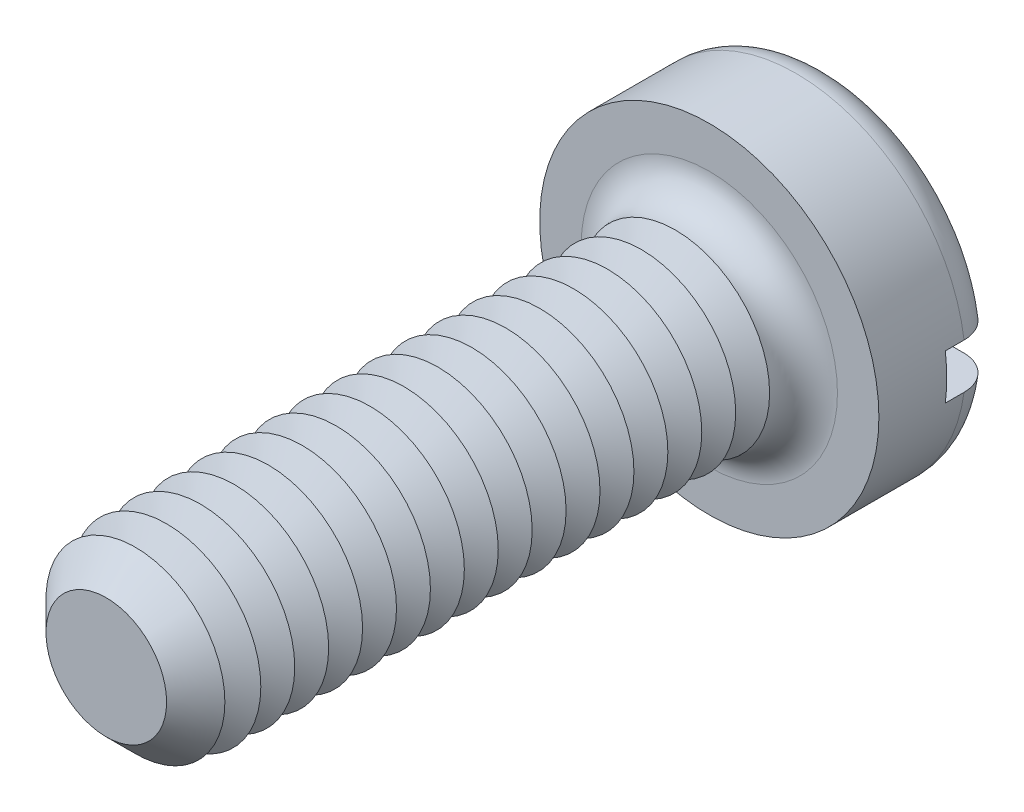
ISO-10303-21;
HEADER;
FILE_DESCRIPTION(('STEP AP214'),'2;1');
FILE_NAME('part.step','',(''),(''),'','','');
FILE_SCHEMA(('AUTOMOTIVE_DESIGN { 1 0 10303 214 1 1 1 1 }'));
ENDSEC;
DATA;
#1=APPLICATION_CONTEXT('core data for automotive mechanical design processes');
#2=APPLICATION_PROTOCOL_DEFINITION('international standard','automotive_design',2000,#1);
#3=PRODUCT_CONTEXT('',#1,'mechanical');
#4=PRODUCT('Part','Part','',(#3));
#5=PRODUCT_RELATED_PRODUCT_CATEGORY('part','',(#4));
#6=PRODUCT_DEFINITION_FORMATION('','',#4);
#7=PRODUCT_DEFINITION_CONTEXT('part definition',#1,'design');
#8=PRODUCT_DEFINITION('design','',#6,#7);
#9=PRODUCT_DEFINITION_SHAPE('','',#8);
#10=(LENGTH_UNIT() NAMED_UNIT(*) SI_UNIT(.MILLI.,.METRE.));
#11=(NAMED_UNIT(*) PLANE_ANGLE_UNIT() SI_UNIT($,.RADIAN.));
#12=(NAMED_UNIT(*) SI_UNIT($,.STERADIAN.) SOLID_ANGLE_UNIT());
#13=UNCERTAINTY_MEASURE_WITH_UNIT(LENGTH_MEASURE(1.E-05),#10,'distance_accuracy_value','');
#14=(GEOMETRIC_REPRESENTATION_CONTEXT(3) GLOBAL_UNCERTAINTY_ASSIGNED_CONTEXT((#13)) GLOBAL_UNIT_ASSIGNED_CONTEXT((#10,
#11,#12)) REPRESENTATION_CONTEXT('',''));
#15=CARTESIAN_POINT('',(0.,0.,0.));
#16=DIRECTION('',(0.,0.,1.));
#17=DIRECTION('',(1.,0.,0.));
#18=AXIS2_PLACEMENT_3D('',#15,#16,#17);
#19=CARTESIAN_POINT('',(0.,0.,-1.6));
#20=DIRECTION('',(0.,0.,1.));
#21=DIRECTION('',(1.,0.,0.));
#22=AXIS2_PLACEMENT_3D('',#19,#20,#21);
#23=PLANE('',#22);
#24=CARTESIAN_POINT('',(0.,0.,-1.6));
#25=DIRECTION('',(0.,0.,1.));
#26=DIRECTION('',(1.,0.,0.));
#27=AXIS2_PLACEMENT_3D('',#24,#25,#26);
#28=CIRCLE('',#27,1.8);
#29=CARTESIAN_POINT('',(-1.77482393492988,0.3,-1.6));
#30=VERTEX_POINT('',#29);
#31=CARTESIAN_POINT('',(1.77482393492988,0.3,-1.6));
#32=VERTEX_POINT('',#31);
#33=EDGE_CURVE('E116',#30,#32,#28,.F.);
#34=ORIENTED_EDGE('',*,*,#33,.T.);
#35=DIRECTION('',(1.,0.,0.));
#36=VECTOR('',#35,1.);
#37=CARTESIAN_POINT('',(-2.25,0.3,-1.6));
#38=LINE('',#37,#36);
#39=EDGE_CURVE('E111',#30,#32,#38,.T.);
#40=ORIENTED_EDGE('',*,*,#39,.F.);
#41=EDGE_LOOP('',(#34,#40));
#42=FACE_BOUND('',#41,.T.);
#43=ADVANCED_FACE('F39',(#42),#23,.F.);
#44=CARTESIAN_POINT('',(0.,0.,-1.15));
#45=DIRECTION('',(0.,0.,1.));
#46=DIRECTION('',(1.,0.,0.));
#47=AXIS2_PLACEMENT_3D('',#44,#45,#46);
#48=TOROIDAL_SURFACE('',#47,1.8,0.45);
#49=CARTESIAN_POINT('',(-2.09367249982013,0.3,-1.4713087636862));
#50=CARTESIAN_POINT('',(-2.07531034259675,0.3,-1.48912990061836));
#51=CARTESIAN_POINT('',(-2.05541605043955,0.3,-1.50540110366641));
#52=CARTESIAN_POINT('',(-2.01315405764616,0.3,-1.53437465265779));
#53=CARTESIAN_POINT('',(-1.99078310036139,0.3,-1.54707221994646));
#54=CARTESIAN_POINT('',(-1.94425163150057,0.3,-1.56853090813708));
#55=CARTESIAN_POINT('',(-1.92009286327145,0.3,-1.57729580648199));
#56=CARTESIAN_POINT('',(-1.8706617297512,0.3,-1.59068015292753));
#57=CARTESIAN_POINT('',(-1.84538964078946,0.3,-1.59530062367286));
#58=CARTESIAN_POINT('',(-1.7942134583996,0.3,-1.60031507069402));
#59=CARTESIAN_POINT('',(-1.76830582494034,0.3,-1.60067291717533));
#60=CARTESIAN_POINT('',(-1.71679040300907,0.3,-1.59707477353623));
#61=CARTESIAN_POINT('',(-1.69118264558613,0.3,-1.59311834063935));
#62=CARTESIAN_POINT('',(-1.64075792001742,0.3,-1.58095464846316));
#63=CARTESIAN_POINT('',(-1.61594989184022,0.3,-1.57271029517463));
#64=CARTESIAN_POINT('',(-1.56806655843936,0.3,-1.55217762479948));
#65=CARTESIAN_POINT('',(-1.54499130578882,0.3,-1.53988918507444));
#66=CARTESIAN_POINT('',(-1.50122413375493,0.3,-1.51158963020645));
#67=CARTESIAN_POINT('',(-1.48053389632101,0.3,-1.49557591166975));
#68=CARTESIAN_POINT('',(-1.44217532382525,0.3,-1.46026359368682));
#69=CARTESIAN_POINT('',(-1.42450683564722,0.3,-1.4409651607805));
#70=CARTESIAN_POINT('',(-1.39293961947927,0.3,-1.39986821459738));
#71=CARTESIAN_POINT('',(-1.37899788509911,0.3,-1.37810275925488));
#72=CARTESIAN_POINT('',(-1.35506190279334,0.3,-1.33249939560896));
#73=CARTESIAN_POINT('',(-1.34506709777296,0.3,-1.30866178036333));
#74=CARTESIAN_POINT('',(-1.3295415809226,0.3,-1.26015137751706));
#75=CARTESIAN_POINT('',(-1.32391771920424,0.3,-1.23550839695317));
#76=CARTESIAN_POINT('',(-1.31696995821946,0.3,-1.18562442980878));
#77=CARTESIAN_POINT('',(-1.31564552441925,0.3,-1.16038351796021));
#78=CARTESIAN_POINT('',(-1.31732714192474,0.3,-1.11049178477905));
#79=CARTESIAN_POINT('',(-1.32025766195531,0.3,-1.08583837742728));
#80=CARTESIAN_POINT('',(-1.3302124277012,0.3,-1.03737369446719));
#81=CARTESIAN_POINT('',(-1.33723664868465,0.3,-1.01356241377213));
#82=CARTESIAN_POINT('',(-1.35515820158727,0.3,-0.967413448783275));
#83=CARTESIAN_POINT('',(-1.36606032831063,0.3,-0.945077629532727));
#84=CARTESIAN_POINT('',(-1.39139351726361,0.3,-0.902507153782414));
#85=CARTESIAN_POINT('',(-1.40582489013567,0.3,-0.882272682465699));
#86=CARTESIAN_POINT('',(-1.43808691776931,0.3,-0.844072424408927));
#87=CARTESIAN_POINT('',(-1.4559757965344,0.3,-0.826155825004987));
#88=CARTESIAN_POINT('',(-1.49445205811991,0.3,-0.793502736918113));
#89=CARTESIAN_POINT('',(-1.51503974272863,0.3,-0.778766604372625));
#90=CARTESIAN_POINT('',(-1.55880475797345,0.3,-0.752571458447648));
#91=CARTESIAN_POINT('',(-1.58202794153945,0.3,-0.741189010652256));
#92=CARTESIAN_POINT('',(-1.63004083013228,0.3,-0.722432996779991));
#93=CARTESIAN_POINT('',(-1.65483064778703,0.3,-0.715059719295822));
#94=CARTESIAN_POINT('',(-1.70558060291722,0.3,-0.704463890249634));
#95=CARTESIAN_POINT('',(-1.73155090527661,0.3,-0.701289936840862));
#96=CARTESIAN_POINT('',(-1.78365633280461,0.3,-0.699350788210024));
#97=CARTESIAN_POINT('',(-1.80979145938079,0.3,-0.700585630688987));
#98=CARTESIAN_POINT('',(-1.86145503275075,0.3,-0.70744393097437));
#99=CARTESIAN_POINT('',(-1.88698403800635,0.3,-0.713063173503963));
#100=CARTESIAN_POINT('',(-1.93672112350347,0.3,-0.728546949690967));
#101=CARTESIAN_POINT('',(-1.96092925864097,0.3,-0.738411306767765));
#102=CARTESIAN_POINT('',(-2.00710191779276,0.3,-0.762015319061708));
#103=CARTESIAN_POINT('',(-2.02908465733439,0.3,-0.775719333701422));
#104=CARTESIAN_POINT('',(-2.0704025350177,0.3,-0.806663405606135));
#105=CARTESIAN_POINT('',(-2.08973782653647,0.3,-0.823903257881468));
#106=CARTESIAN_POINT('',(-2.12497879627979,0.3,-0.861218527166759));
#107=CARTESIAN_POINT('',(-2.1409209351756,0.3,-0.881259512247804));
#108=CARTESIAN_POINT('',(-2.16917502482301,0.3,-0.92375535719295));
#109=CARTESIAN_POINT('',(-2.18148717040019,0.3,-0.946210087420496));
#110=CARTESIAN_POINT('',(-2.20201023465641,0.3,-0.99266079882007));
#111=CARTESIAN_POINT('',(-2.21025973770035,0.3,-1.01663973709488));
#112=CARTESIAN_POINT('',(-2.22258852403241,0.3,-1.06564563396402));
#113=CARTESIAN_POINT('',(-2.22666813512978,0.3,-1.0906725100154));
#114=CARTESIAN_POINT('',(-2.23052418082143,0.3,-1.14090288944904));
#115=CARTESIAN_POINT('',(-2.23032644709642,0.3,-1.16610441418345));
#116=CARTESIAN_POINT('',(-2.22569614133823,0.3,-1.21612212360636));
#117=CARTESIAN_POINT('',(-2.2212625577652,0.3,-1.24093821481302));
#118=CARTESIAN_POINT('',(-2.20829785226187,0.3,-1.2894516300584));
#119=CARTESIAN_POINT('',(-2.19976997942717,0.3,-1.31314982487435));
#120=CARTESIAN_POINT('',(-2.17887390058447,0.3,-1.35876313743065));
#121=CARTESIAN_POINT('',(-2.1665103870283,0.3,-1.3806803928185));
#122=CARTESIAN_POINT('',(-2.14384463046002,0.3,-1.4140108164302));
#123=CARTESIAN_POINT('',(-2.13462949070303,0.3,-1.42617780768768));
#124=CARTESIAN_POINT('',(-2.1150151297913,0.3,-1.44951629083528));
#125=CARTESIAN_POINT('',(-2.10461591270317,0.3,-1.46068778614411));
#126=CARTESIAN_POINT('',(-2.09367249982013,0.3,-1.4713087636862));
#127=B_SPLINE_CURVE_WITH_KNOTS('',3,(#49,#50,#51,#52,#53,#54,#55,#56,#57,#58,#59,#60,#61,#62,
#63,#64,#65,#66,#67,#68,#69,#70,#71,#72,#73,#74,#75,#76,#77,#78,#79,#80,#81,#82,#83,#84,#85,#86,
#87,#88,#89,#90,#91,#92,#93,#94,#95,#96,#97,#98,#99,#100,#101,#102,#103,#104,#105,#106,#107,
#108,#109,#110,#111,#112,#113,#114,#115,#116,#117,#118,#119,#120,#121,#122,#123,#124,#125,#126),
.UNSPECIFIED.,.T.,.F.,(4,2,2,2,2,2,2,2,2,2,2,2,2,2,2,2,2,2,2,2,2,2,2,2,2,2,2,2,2,2,2,2,2,2,2,2,
2,2,4),(0.,0.0767085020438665,0.153519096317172,0.230255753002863,0.306973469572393,
0.384340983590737,0.461716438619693,0.539772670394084,0.617831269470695,0.695944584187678,
0.774053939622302,0.851218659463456,0.928372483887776,1.00383319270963,1.07928451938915,
1.15341274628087,1.22754052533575,1.30176027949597,1.37598656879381,1.45159320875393,
1.52720831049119,1.6044355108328,1.68166826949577,1.75978723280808,1.8379068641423,
1.91595148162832,1.99399285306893,2.07133254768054,2.14866775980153,2.22512456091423,
2.30157725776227,2.3772891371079,2.45299506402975,2.52824391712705,2.60351074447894,
2.67871794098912,2.75383349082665,2.79955010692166,2.84526656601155),.UNSPECIFIED.);
#128=CARTESIAN_POINT('',(-2.22991031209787,0.3,-1.14999999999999));
#129=VERTEX_POINT('',#128);
#130=EDGE_CURVE('E313',#129,#30,#127,.T.);
#131=ORIENTED_EDGE('',*,*,#130,.F.);
#132=CARTESIAN_POINT('',(0.,0.,-1.15));
#133=DIRECTION('',(0.,0.,1.));
#134=DIRECTION('',(1.,0.,0.));
#135=AXIS2_PLACEMENT_3D('',#132,#133,#134);
#136=CIRCLE('',#135,2.25);
#137=CARTESIAN_POINT('',(2.22991031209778,0.3,-1.15));
#138=VERTEX_POINT('',#137);
#139=EDGE_CURVE('E125',#138,#129,#136,.T.);
#140=ORIENTED_EDGE('',*,*,#139,.F.);
#141=CARTESIAN_POINT('',(1.39325818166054,0.3,-1.39903402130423));
#142=CARTESIAN_POINT('',(1.40771723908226,0.3,-1.42030595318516));
#143=CARTESIAN_POINT('',(1.4240122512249,0.3,-1.4403555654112));
#144=CARTESIAN_POINT('',(1.45976320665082,0.3,-1.4774406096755));
#145=CARTESIAN_POINT('',(1.47922380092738,0.3,-1.49447152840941));
#146=CARTESIAN_POINT('',(1.5206923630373,0.3,-1.52502510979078));
#147=CARTESIAN_POINT('',(1.54269721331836,0.3,-1.53855200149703));
#148=CARTESIAN_POINT('',(1.58863815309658,0.3,-1.56176272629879));
#149=CARTESIAN_POINT('',(1.61257369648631,0.3,-1.57144764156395));
#150=CARTESIAN_POINT('',(1.66199169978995,0.3,-1.58680804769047));
#151=CARTESIAN_POINT('',(1.68748839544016,0.3,-1.59243778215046));
#152=CARTESIAN_POINT('',(1.73906656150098,0.3,-1.59934902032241));
#153=CARTESIAN_POINT('',(1.76514807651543,0.3,-1.60063019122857));
#154=CARTESIAN_POINT('',(1.81721740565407,0.3,-1.59879130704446));
#155=CARTESIAN_POINT('',(1.84320486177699,0.3,-1.59566102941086));
#156=CARTESIAN_POINT('',(1.89427635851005,0.3,-1.58504931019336));
#157=CARTESIAN_POINT('',(1.91936042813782,0.3,-1.57756800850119));
#158=CARTESIAN_POINT('',(1.9677137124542,0.3,-1.55851722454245));
#159=CARTESIAN_POINT('',(1.99099484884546,0.3,-1.5469780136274));
#160=CARTESIAN_POINT('',(2.03525897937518,0.3,-1.52011224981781));
#161=CARTESIAN_POINT('',(2.05624211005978,0.3,-1.50478592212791));
#162=CARTESIAN_POINT('',(2.09506403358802,0.3,-1.47096472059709));
#163=CARTESIAN_POINT('',(2.11293536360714,0.3,-1.45250719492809));
#164=CARTESIAN_POINT('',(2.14528563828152,0.3,-1.41282609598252));
#165=CARTESIAN_POINT('',(2.15976477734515,0.3,-1.39160268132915));
#166=CARTESIAN_POINT('',(2.18476262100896,0.3,-1.34723254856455));
#167=CARTESIAN_POINT('',(2.19532119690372,0.3,-1.32410828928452));
#168=CARTESIAN_POINT('',(2.21237438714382,0.3,-1.27640693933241));
#169=CARTESIAN_POINT('',(2.21886918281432,0.3,-1.25182991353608));
#170=CARTESIAN_POINT('',(2.2275687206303,0.3,-1.20210937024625));
#171=CARTESIAN_POINT('',(2.22980376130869,0.3,-1.17697115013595));
#172=CARTESIAN_POINT('',(2.23000940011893,0.3,-1.12667754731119));
#173=CARTESIAN_POINT('',(2.22798009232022,0.3,-1.10152216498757));
#174=CARTESIAN_POINT('',(2.21972856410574,0.3,-1.05197773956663));
#175=CARTESIAN_POINT('',(2.21351744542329,0.3,-1.02758684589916));
#176=CARTESIAN_POINT('',(2.19709696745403,0.3,-0.980190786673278));
#177=CARTESIAN_POINT('',(2.18688760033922,0.3,-0.957185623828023));
#178=CARTESIAN_POINT('',(2.1627435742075,0.3,-0.913157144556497));
#179=CARTESIAN_POINT('',(2.14880093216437,0.3,-0.892138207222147));
#180=CARTESIAN_POINT('',(2.11760640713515,0.3,-0.852719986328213));
#181=CARTESIAN_POINT('',(2.10035443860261,0.3,-0.834320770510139));
#182=CARTESIAN_POINT('',(2.06291254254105,0.3,-0.80052923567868));
#183=CARTESIAN_POINT('',(2.04270386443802,0.3,-0.785157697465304));
#184=CARTESIAN_POINT('',(2.0000139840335,0.3,-0.757986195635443));
#185=CARTESIAN_POINT('',(1.97753267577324,0.3,-0.746186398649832));
#186=CARTESIAN_POINT('',(1.93069507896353,0.3,-0.726364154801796));
#187=CARTESIAN_POINT('',(1.90632219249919,0.3,-0.718380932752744));
#188=CARTESIAN_POINT('',(1.85658993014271,0.3,-0.706569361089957));
#189=CARTESIAN_POINT('',(1.83123049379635,0.3,-0.702741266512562));
#190=CARTESIAN_POINT('',(1.77994107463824,0.3,-0.699306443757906));
#191=CARTESIAN_POINT('',(1.75400788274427,0.3,-0.69974759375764));
#192=CARTESIAN_POINT('',(1.70257608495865,0.3,-0.704939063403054));
#193=CARTESIAN_POINT('',(1.67707750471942,0.3,-0.709689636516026));
#194=CARTESIAN_POINT('',(1.62701662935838,0.3,-0.723419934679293));
#195=CARTESIAN_POINT('',(1.60246387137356,0.3,-0.732434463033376));
#196=CARTESIAN_POINT('',(1.55521886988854,0.3,-0.754458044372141));
#197=CARTESIAN_POINT('',(1.53252668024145,0.3,-0.76746721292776));
#198=CARTESIAN_POINT('',(1.48966925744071,0.3,-0.797124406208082));
#199=CARTESIAN_POINT('',(1.46950315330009,0.3,-0.813771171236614));
#200=CARTESIAN_POINT('',(1.43229728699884,0.3,-0.850255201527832));
#201=CARTESIAN_POINT('',(1.41525734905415,0.3,-0.870092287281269));
#202=CARTESIAN_POINT('',(1.3850470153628,0.3,-0.912123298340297));
#203=CARTESIAN_POINT('',(1.37182821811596,0.3,-0.934282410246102));
#204=CARTESIAN_POINT('',(1.34939737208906,0.3,-0.980542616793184));
#205=CARTESIAN_POINT('',(1.34018456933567,0.3,-1.00464334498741));
#206=CARTESIAN_POINT('',(1.32624172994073,0.3,-1.05352472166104));
#207=CARTESIAN_POINT('',(1.32141599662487,0.3,-1.07827808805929));
#208=CARTESIAN_POINT('',(1.31606478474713,0.3,-1.12825155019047));
#209=CARTESIAN_POINT('',(1.31553992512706,0.3,-1.15347171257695));
#210=CARTESIAN_POINT('',(1.31878307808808,0.3,-1.20323022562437));
#211=CARTESIAN_POINT('',(1.32248353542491,0.3,-1.22777305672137));
#212=CARTESIAN_POINT('',(1.33394086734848,0.3,-1.27586981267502));
#213=CARTESIAN_POINT('',(1.34169274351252,0.3,-1.2994249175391));
#214=CARTESIAN_POINT('',(1.35704250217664,0.3,-1.33561898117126));
#215=CARTESIAN_POINT('',(1.36341395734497,0.3,-1.34879219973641));
#216=CARTESIAN_POINT('',(1.37741190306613,0.3,-1.37445328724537));
#217=CARTESIAN_POINT('',(1.38503837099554,0.3,-1.38694116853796));
#218=CARTESIAN_POINT('',(1.39325818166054,0.3,-1.39903402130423));
#219=B_SPLINE_CURVE_WITH_KNOTS('',3,(#141,#142,#143,#144,#145,#146,#147,#148,#149,#150,#151,
#152,#153,#154,#155,#156,#157,#158,#159,#160,#161,#162,#163,#164,#165,#166,#167,#168,#169,#170,
#171,#172,#173,#174,#175,#176,#177,#178,#179,#180,#181,#182,#183,#184,#185,#186,#187,#188,#189,
#190,#191,#192,#193,#194,#195,#196,#197,#198,#199,#200,#201,#202,#203,#204,#205,#206,#207,#208,
#209,#210,#211,#212,#213,#214,#215,#216,#217,#218),.UNSPECIFIED.,.T.,.F.,(4,2,2,2,2,2,2,2,2,2,2,
2,2,2,2,2,2,2,2,2,2,2,2,2,2,2,2,2,2,2,2,2,2,2,2,2,2,2,4),(0.,0.0771077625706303,
0.154329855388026,0.231458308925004,0.308565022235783,0.386528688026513,0.464498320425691,
0.542648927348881,0.620797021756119,0.698374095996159,0.77594655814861,0.852651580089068,
0.929352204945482,1.00524992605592,1.08114426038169,1.15649673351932,1.2318475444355,
1.30699910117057,1.38215080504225,1.45746451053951,1.53278016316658,1.60859599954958,
1.68441537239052,1.76099806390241,1.83758545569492,1.91503273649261,1.99248457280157,
2.07057979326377,2.14867727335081,2.22674775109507,2.30481383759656,2.38184276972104,
2.45885719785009,2.53414829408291,2.6094502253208,2.68356487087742,2.75758829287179,
2.80142397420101,2.84525886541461),.UNSPECIFIED.);
#220=EDGE_CURVE('E315',#32,#138,#219,.T.);
#221=ORIENTED_EDGE('',*,*,#220,.F.);
#222=ORIENTED_EDGE('',*,*,#33,.F.);
#223=EDGE_LOOP('',(#131,#140,#221,#222));
#224=FACE_BOUND('',#223,.T.);
#225=ADVANCED_FACE('F297',(#224),#48,.T.);
#226=CARTESIAN_POINT('',(0.,0.,-1.6));
#227=DIRECTION('',(0.,0.,1.));
#228=DIRECTION('',(1.,0.,0.));
#229=AXIS2_PLACEMENT_3D('',#226,#227,#228);
#230=CYLINDRICAL_SURFACE('',#229,2.25);
#231=DIRECTION('',(0.,0.,1.));
#232=VECTOR('',#231,1.);
#233=CARTESIAN_POINT('',(2.22991031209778,0.3,-1.6));
#234=LINE('',#233,#232);
#235=CARTESIAN_POINT('',(2.22991031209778,0.3,-0.9));
#236=VERTEX_POINT('',#235);
#237=EDGE_CURVE('E330',#138,#236,#234,.T.);
#238=ORIENTED_EDGE('',*,*,#237,.F.);
#239=ORIENTED_EDGE('',*,*,#139,.T.);
#240=DIRECTION('',(0.,0.,1.));
#241=VECTOR('',#240,1.);
#242=CARTESIAN_POINT('',(-2.22991031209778,0.3,-1.6));
#243=LINE('',#242,#241);
#244=CARTESIAN_POINT('',(-2.22991031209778,0.3,-0.9));
#245=VERTEX_POINT('',#244);
#246=EDGE_CURVE('E63',#245,#129,#243,.F.);
#247=ORIENTED_EDGE('',*,*,#246,.F.);
#248=CARTESIAN_POINT('',(0.,0.,-0.9));
#249=DIRECTION('',(0.,0.,-1.));
#250=DIRECTION('',(-1.,0.,0.));
#251=AXIS2_PLACEMENT_3D('',#248,#249,#250);
#252=CIRCLE('',#251,2.25);
#253=CARTESIAN_POINT('',(-2.22991031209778,-0.3,-0.9));
#254=VERTEX_POINT('',#253);
#255=EDGE_CURVE('E43',#245,#254,#252,.F.);
#256=ORIENTED_EDGE('',*,*,#255,.T.);
#257=DIRECTION('',(0.,0.,1.));
#258=VECTOR('',#257,1.);
#259=CARTESIAN_POINT('',(-2.22991031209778,-0.3,-1.6));
#260=LINE('',#259,#258);
#261=CARTESIAN_POINT('',(-2.22991031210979,-0.3,-1.15000000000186));
#262=VERTEX_POINT('',#261);
#263=EDGE_CURVE('E327',#262,#254,#260,.T.);
#264=ORIENTED_EDGE('',*,*,#263,.F.);
#265=CARTESIAN_POINT('',(2.22991031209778,-0.3,-1.15));
#266=VERTEX_POINT('',#265);
#267=EDGE_CURVE('E127',#262,#266,#136,.T.);
#268=ORIENTED_EDGE('',*,*,#267,.T.);
#269=DIRECTION('',(0.,0.,1.));
#270=VECTOR('',#269,1.);
#271=CARTESIAN_POINT('',(2.22991031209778,-0.3,-1.6));
#272=LINE('',#271,#270);
#273=CARTESIAN_POINT('',(2.22991031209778,-0.3,-0.9));
#274=VERTEX_POINT('',#273);
#275=EDGE_CURVE('E55',#274,#266,#272,.F.);
#276=ORIENTED_EDGE('',*,*,#275,.F.);
#277=EDGE_CURVE('E11',#274,#236,#252,.F.);
#278=ORIENTED_EDGE('',*,*,#277,.T.);
#279=EDGE_LOOP('',(#238,#239,#247,#256,#264,#268,#276,#278));
#280=FACE_BOUND('',#279,.T.);
#281=CARTESIAN_POINT('',(0.,0.,0.));
#282=DIRECTION('',(0.,0.,1.));
#283=DIRECTION('',(1.,0.,0.));
#284=AXIS2_PLACEMENT_3D('',#281,#282,#283);
#285=CIRCLE('',#284,2.25);
#286=CARTESIAN_POINT('',(2.25,0.,0.));
#287=VERTEX_POINT('',#286);
#288=EDGE_CURVE('E333',#287,#287,#285,.T.);
#289=ORIENTED_EDGE('',*,*,#288,.F.);
#290=EDGE_LOOP('',(#289));
#291=FACE_BOUND('',#290,.T.);
#292=ADVANCED_FACE('F293',(#280,#291),#230,.T.);
#293=CARTESIAN_POINT('',(1.77482393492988,-0.3,-1.6));
#294=VERTEX_POINT('',#293);
#295=CARTESIAN_POINT('',(-1.77482393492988,-0.3,-1.6));
#296=VERTEX_POINT('',#295);
#297=EDGE_CURVE('E109',#294,#296,#28,.F.);
#298=ORIENTED_EDGE('',*,*,#297,.T.);
#299=DIRECTION('',(-1.,0.,0.));
#300=VECTOR('',#299,1.);
#301=CARTESIAN_POINT('',(-2.25,-0.3,-1.6));
#302=LINE('',#301,#300);
#303=EDGE_CURVE('E96',#294,#296,#302,.T.);
#304=ORIENTED_EDGE('',*,*,#303,.F.);
#305=EDGE_LOOP('',(#298,#304));
#306=FACE_BOUND('',#305,.T.);
#307=ADVANCED_FACE('F108',(#306),#23,.F.);
#308=CARTESIAN_POINT('',(0.,0.,0.));
#309=DIRECTION('',(0.,0.,1.));
#310=DIRECTION('',(1.,0.,0.));
#311=AXIS2_PLACEMENT_3D('',#308,#309,#310);
#312=PLANE('',#311);
#313=CARTESIAN_POINT('',(0.,0.,0.));
#314=DIRECTION('',(0.,0.,1.));
#315=DIRECTION('',(1.,0.,0.));
#316=AXIS2_PLACEMENT_3D('',#313,#314,#315);
#317=CIRCLE('',#316,1.7);
#318=CARTESIAN_POINT('',(1.7,0.,0.));
#319=VERTEX_POINT('',#318);
#320=EDGE_CURVE('E115',#319,#319,#317,.F.);
#321=ORIENTED_EDGE('',*,*,#320,.T.);
#322=EDGE_LOOP('',(#321));
#323=FACE_BOUND('',#322,.T.);
#324=ORIENTED_EDGE('',*,*,#288,.T.);
#325=EDGE_LOOP('',(#324));
#326=FACE_BOUND('',#325,.T.);
#327=ADVANCED_FACE('F292',(#323,#326),#312,.T.);
#328=CARTESIAN_POINT('',(-2.09367249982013,-0.3,-1.4713087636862));
#329=CARTESIAN_POINT('',(-2.11176539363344,-0.3,-1.45374579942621));
#330=CARTESIAN_POINT('',(-2.1283968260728,-0.3,-1.43465254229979));
#331=CARTESIAN_POINT('',(-2.15823692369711,-0.3,-1.39393307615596));
#332=CARTESIAN_POINT('',(-2.17144184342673,-0.3,-1.37230413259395));
#333=CARTESIAN_POINT('',(-2.19402281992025,-0.3,-1.32713362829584));
#334=CARTESIAN_POINT('',(-2.20339951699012,-0.3,-1.30359238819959));
#335=CARTESIAN_POINT('',(-2.21804409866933,-0.3,-1.25527081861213));
#336=CARTESIAN_POINT('',(-2.22331295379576,-0.3,-1.23049078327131));
#337=CARTESIAN_POINT('',(-2.22957448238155,-0.3,-1.18050893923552));
#338=CARTESIAN_POINT('',(-2.23058617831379,-0.3,-1.15530951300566));
#339=CARTESIAN_POINT('',(-2.22835535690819,-0.3,-1.10509920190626));
#340=CARTESIAN_POINT('',(-2.22511277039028,-0.3,-1.08008832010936));
#341=CARTESIAN_POINT('',(-2.21448018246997,-0.3,-1.03101646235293));
#342=CARTESIAN_POINT('',(-2.20709836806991,-0.3,-1.00695371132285));
#343=CARTESIAN_POINT('',(-2.18841075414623,-0.3,-0.960404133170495));
#344=CARTESIAN_POINT('',(-2.17710493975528,-0.3,-0.937917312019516));
#345=CARTESIAN_POINT('',(-2.15086234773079,-0.3,-0.895085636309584));
#346=CARTESIAN_POINT('',(-2.13591537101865,-0.3,-0.874747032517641));
#347=CARTESIAN_POINT('',(-2.1028415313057,-0.3,-0.836845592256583));
#348=CARTESIAN_POINT('',(-2.08471458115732,-0.3,-0.819282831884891));
#349=CARTESIAN_POINT('',(-2.0456590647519,-0.3,-0.78729174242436));
#350=CARTESIAN_POINT('',(-2.0247112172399,-0.3,-0.772886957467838));
#351=CARTESIAN_POINT('',(-1.98071452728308,-0.3,-0.747756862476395));
#352=CARTESIAN_POINT('',(-1.95766557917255,-0.3,-0.737031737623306));
#353=CARTESIAN_POINT('',(-1.90986554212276,-0.3,-0.71944451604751));
#354=CARTESIAN_POINT('',(-1.88509923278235,-0.3,-0.712623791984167));
#355=CARTESIAN_POINT('',(-1.83477837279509,-0.3,-0.703186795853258));
#356=CARTESIAN_POINT('',(-1.80922377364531,-0.3,-0.700570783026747));
#357=CARTESIAN_POINT('',(-1.75774893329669,-0.3,-0.699591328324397));
#358=CARTESIAN_POINT('',(-1.73182778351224,-0.3,-0.701275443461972));
#359=CARTESIAN_POINT('',(-1.68062744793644,-0.3,-0.708937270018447));
#360=CARTESIAN_POINT('',(-1.65534829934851,-0.3,-0.714915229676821));
#361=CARTESIAN_POINT('',(-1.6059539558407,-0.3,-0.731056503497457));
#362=CARTESIAN_POINT('',(-1.58184881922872,-0.3,-0.741250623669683));
#363=CARTESIAN_POINT('',(-1.53569497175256,-0.3,-0.765548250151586));
#364=CARTESIAN_POINT('',(-1.51364629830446,-0.3,-0.779651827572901));
#365=CARTESIAN_POINT('',(-1.47229470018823,-0.3,-0.811355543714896));
#366=CARTESIAN_POINT('',(-1.45298625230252,-0.3,-0.828948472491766));
#367=CARTESIAN_POINT('',(-1.41765142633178,-0.3,-0.867170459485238));
#368=CARTESIAN_POINT('',(-1.40162480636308,-0.3,-0.887799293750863));
#369=CARTESIAN_POINT('',(-1.37358365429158,-0.3,-0.93118317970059));
#370=CARTESIAN_POINT('',(-1.3615121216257,-0.3,-0.953901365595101));
#371=CARTESIAN_POINT('',(-1.34145576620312,-0.3,-1.00107529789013));
#372=CARTESIAN_POINT('',(-1.33347032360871,-0.3,-1.02553078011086));
#373=CARTESIAN_POINT('',(-1.32199536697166,-0.3,-1.07489401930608));
#374=CARTESIAN_POINT('',(-1.31840873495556,-0.3,-1.09977921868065));
#375=CARTESIAN_POINT('',(-1.31553052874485,-0.3,-1.1497957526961));
#376=CARTESIAN_POINT('',(-1.31623852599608,-0.3,-1.17492706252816));
#377=CARTESIAN_POINT('',(-1.32188368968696,-0.3,-1.22435119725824));
#378=CARTESIAN_POINT('',(-1.32676151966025,-0.3,-1.24865083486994));
#379=CARTESIAN_POINT('',(-1.34050334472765,-0.3,-1.29609421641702));
#380=CARTESIAN_POINT('',(-1.34936742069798,-0.3,-1.31923793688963));
#381=CARTESIAN_POINT('',(-1.37086295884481,-0.3,-1.36387796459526));
#382=CARTESIAN_POINT('',(-1.38351729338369,-0.3,-1.38536324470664));
#383=CARTESIAN_POINT('',(-1.41218367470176,-0.3,-1.42596199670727));
#384=CARTESIAN_POINT('',(-1.42819606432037,-0.3,-1.44507522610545));
#385=CARTESIAN_POINT('',(-1.46347664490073,-0.3,-1.48081087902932));
#386=CARTESIAN_POINT('',(-1.48280543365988,-0.3,-1.49737347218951));
#387=CARTESIAN_POINT('',(-1.5239232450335,-0.3,-1.52709508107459));
#388=CARTESIAN_POINT('',(-1.54571253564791,-0.3,-1.54025372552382));
#389=CARTESIAN_POINT('',(-1.59160097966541,-0.3,-1.56305446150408));
#390=CARTESIAN_POINT('',(-1.61573734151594,-0.3,-1.57262172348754));
#391=CARTESIAN_POINT('',(-1.66526504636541,-0.3,-1.58760700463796));
#392=CARTESIAN_POINT('',(-1.69065641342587,-0.3,-1.59302494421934));
#393=CARTESIAN_POINT('',(-1.74220154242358,-0.3,-1.59958446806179));
#394=CARTESIAN_POINT('',(-1.7683598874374,-0.3,-1.60069012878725));
#395=CARTESIAN_POINT('',(-1.82049681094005,-0.3,-1.59847888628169));
#396=CARTESIAN_POINT('',(-1.8464753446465,-0.3,-1.59516091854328));
#397=CARTESIAN_POINT('',(-1.89742078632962,-0.3,-1.58419269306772));
#398=CARTESIAN_POINT('',(-1.92239041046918,-0.3,-1.57655503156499));
#399=CARTESIAN_POINT('',(-1.97064988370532,-0.3,-1.55715679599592));
#400=CARTESIAN_POINT('',(-1.99394179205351,-0.3,-1.54540138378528));
#401=CARTESIAN_POINT('',(-2.03003215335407,-0.3,-1.52312594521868));
#402=CARTESIAN_POINT('',(-2.04354254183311,-0.3,-1.51373809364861));
#403=CARTESIAN_POINT('',(-2.06946640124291,-0.3,-1.49355310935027));
#404=CARTESIAN_POINT('',(-2.08187987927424,-0.3,-1.48275598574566));
#405=CARTESIAN_POINT('',(-2.09367249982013,-0.3,-1.4713087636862));
#406=B_SPLINE_CURVE_WITH_KNOTS('',3,(#328,#329,#330,#331,#332,#333,#334,#335,#336,#337,#338,
#339,#340,#341,#342,#343,#344,#345,#346,#347,#348,#349,#350,#351,#352,#353,#354,#355,#356,#357,
#358,#359,#360,#361,#362,#363,#364,#365,#366,#367,#368,#369,#370,#371,#372,#373,#374,#375,#376,
#377,#378,#379,#380,#381,#382,#383,#384,#385,#386,#387,#388,#389,#390,#391,#392,#393,#394,#395,
#396,#397,#398,#399,#400,#401,#402,#403,#404,#405),.UNSPECIFIED.,.T.,.F.,(4,2,2,2,2,2,2,2,2,2,2,
2,2,2,2,2,2,2,2,2,2,2,2,2,2,2,2,2,2,2,2,2,2,2,2,2,2,2,4),(0.,0.0755864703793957,
0.151255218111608,0.226911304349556,0.302549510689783,0.377849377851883,0.453150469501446,
0.528303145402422,0.603456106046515,0.67882204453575,0.754190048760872,0.83010216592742,
0.906018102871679,0.982724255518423,1.05943513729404,1.13699806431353,1.21456547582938,
1.29270994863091,1.37085584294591,1.44884191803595,1.52682224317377,1.60362346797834,
1.68041303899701,1.75547480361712,1.83052907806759,1.90453278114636,1.97853798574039,
2.05299909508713,2.12746781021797,2.20347986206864,2.27950020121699,2.3570265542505,
2.43455439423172,2.5127267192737,2.59091785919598,2.66888216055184,2.74674907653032,
2.79601528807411,2.84528118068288),.UNSPECIFIED.);
#407=EDGE_CURVE('E103',#296,#262,#406,.T.);
#408=ORIENTED_EDGE('',*,*,#407,.F.);
#409=ORIENTED_EDGE('',*,*,#297,.F.);
#410=CARTESIAN_POINT('',(1.39325818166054,-0.3,-1.39903402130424));
#411=CARTESIAN_POINT('',(1.37924349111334,-0.3,-1.37841200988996));
#412=CARTESIAN_POINT('',(1.36693374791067,-0.3,-1.35661225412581));
#413=CARTESIAN_POINT('',(1.34612289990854,-0.3,-1.31124547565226));
#414=CARTESIAN_POINT('',(1.33762533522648,-0.3,-1.28767683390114));
#415=CARTESIAN_POINT('',(1.32472877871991,-0.3,-1.23943261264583));
#416=CARTESIAN_POINT('',(1.3203309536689,-0.3,-1.21475672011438));
#417=CARTESIAN_POINT('',(1.31579198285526,-0.3,-1.16502199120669));
#418=CARTESIAN_POINT('',(1.31564980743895,-0.3,-1.13996324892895));
#419=CARTESIAN_POINT('',(1.31960322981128,-0.3,-1.09044336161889));
#420=CARTESIAN_POINT('',(1.32365524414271,-0.3,-1.06597872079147));
#421=CARTESIAN_POINT('',(1.33579339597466,-0.3,-1.01807218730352));
#422=CARTESIAN_POINT('',(1.34387971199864,-0.3,-0.994630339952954));
#423=CARTESIAN_POINT('',(1.36386460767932,-0.3,-0.949319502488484));
#424=CARTESIAN_POINT('',(1.37577869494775,-0.3,-0.92745736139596));
#425=CARTESIAN_POINT('',(1.40303929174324,-0.3,-0.885990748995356));
#426=CARTESIAN_POINT('',(1.41838612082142,-0.3,-0.866386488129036));
#427=CARTESIAN_POINT('',(1.45239955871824,-0.3,-0.829572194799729));
#428=CARTESIAN_POINT('',(1.47112624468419,-0.3,-0.812417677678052));
#429=CARTESIAN_POINT('',(1.51114353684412,-0.3,-0.78141873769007));
#430=CARTESIAN_POINT('',(1.53243442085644,-0.3,-0.767574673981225));
#431=CARTESIAN_POINT('',(1.57744959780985,-0.3,-0.743302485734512));
#432=CARTESIAN_POINT('',(1.6012148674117,-0.3,-0.732950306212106));
#433=CARTESIAN_POINT('',(1.65013556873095,-0.3,-0.71633816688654));
#434=CARTESIAN_POINT('',(1.67529109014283,-0.3,-0.710078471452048));
#435=CARTESIAN_POINT('',(1.72654223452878,-0.3,-0.701786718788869));
#436=CARTESIAN_POINT('',(1.75264462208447,-0.3,-0.699796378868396));
#437=CARTESIAN_POINT('',(1.80481283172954,-0.3,-0.700236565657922));
#438=CARTESIAN_POINT('',(1.83087865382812,-0.3,-0.702667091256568));
#439=CARTESIAN_POINT('',(1.88216421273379,-0.3,-0.71188843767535));
#440=CARTESIAN_POINT('',(1.90738581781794,-0.3,-0.718668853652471));
#441=CARTESIAN_POINT('',(1.95631449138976,-0.3,-0.736408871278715));
#442=CARTESIAN_POINT('',(1.98002162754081,-0.3,-0.747368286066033));
#443=CARTESIAN_POINT('',(2.02500221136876,-0.3,-0.773046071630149));
#444=CARTESIAN_POINT('',(2.04629687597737,-0.3,-0.78772726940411));
#445=CARTESIAN_POINT('',(2.08608258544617,-0.3,-0.820494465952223));
#446=CARTESIAN_POINT('',(2.10457379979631,-0.3,-0.838580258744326));
#447=CARTESIAN_POINT('',(2.1380062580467,-0.3,-0.877422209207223));
#448=CARTESIAN_POINT('',(2.15298532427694,-0.3,-0.898145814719));
#449=CARTESIAN_POINT('',(2.17921311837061,-0.3,-0.941832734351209));
#450=CARTESIAN_POINT('',(2.19046204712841,-0.3,-0.964795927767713));
#451=CARTESIAN_POINT('',(2.20880507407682,-0.3,-1.01207981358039));
#452=CARTESIAN_POINT('',(2.2159367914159,-0.3,-1.0363859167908));
#453=CARTESIAN_POINT('',(2.22599386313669,-0.3,-1.08585317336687));
#454=CARTESIAN_POINT('',(2.22891936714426,-0.3,-1.11101429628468));
#455=CARTESIAN_POINT('',(2.23047255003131,-0.3,-1.16133395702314));
#456=CARTESIAN_POINT('',(2.22912306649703,-0.3,-1.18649179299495));
#457=CARTESIAN_POINT('',(2.22221641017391,-0.3,-1.236222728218));
#458=CARTESIAN_POINT('',(2.21665928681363,-0.3,-1.26079583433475));
#459=CARTESIAN_POINT('',(2.20150655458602,-0.3,-1.30864604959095));
#460=CARTESIAN_POINT('',(2.19191347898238,-0.3,-1.3319239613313));
#461=CARTESIAN_POINT('',(2.16897085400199,-0.3,-1.37654778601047));
#462=CARTESIAN_POINT('',(2.15562126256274,-0.3,-1.39789367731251));
#463=CARTESIAN_POINT('',(2.12549147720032,-0.3,-1.43814583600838));
#464=CARTESIAN_POINT('',(2.1086973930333,-0.3,-1.45704170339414));
#465=CARTESIAN_POINT('',(2.07219852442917,-0.3,-1.491773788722));
#466=CARTESIAN_POINT('',(2.0524936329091,-0.3,-1.50760989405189));
#467=CARTESIAN_POINT('',(2.01056127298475,-0.3,-1.53591667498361));
#468=CARTESIAN_POINT('',(1.98831430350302,-0.3,-1.54835845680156));
#469=CARTESIAN_POINT('',(1.94206418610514,-0.3,-1.5693763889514));
#470=CARTESIAN_POINT('',(1.91806093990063,-0.3,-1.57795232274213));
#471=CARTESIAN_POINT('',(1.86869953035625,-0.3,-1.5910955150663));
#472=CARTESIAN_POINT('',(1.84332941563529,-0.3,-1.59561788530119));
#473=CARTESIAN_POINT('',(1.7921914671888,-0.3,-1.60038767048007));
#474=CARTESIAN_POINT('',(1.76642362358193,-0.3,-1.60063497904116));
#475=CARTESIAN_POINT('',(1.71493241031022,-0.3,-1.59684388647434));
#476=CARTESIAN_POINT('',(1.6892123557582,-0.3,-1.59276040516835));
#477=CARTESIAN_POINT('',(1.63880694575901,-0.3,-1.58035661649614));
#478=CARTESIAN_POINT('',(1.61412189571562,-0.3,-1.5720350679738));
#479=CARTESIAN_POINT('',(1.56635013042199,-0.3,-1.55132424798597));
#480=CARTESIAN_POINT('',(1.54327365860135,-0.3,-1.53891136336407));
#481=CARTESIAN_POINT('',(1.49956705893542,-0.3,-1.51037484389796));
#482=CARTESIAN_POINT('',(1.478934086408,-0.3,-1.49425558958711));
#483=CARTESIAN_POINT('',(1.44732882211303,-0.3,-1.46489751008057));
#484=CARTESIAN_POINT('',(1.43548118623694,-0.3,-1.45258668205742));
#485=CARTESIAN_POINT('',(1.41324217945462,-0.3,-1.42671249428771));
#486=CARTESIAN_POINT('',(1.40285079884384,-0.3,-1.41314914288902));
#487=CARTESIAN_POINT('',(1.39325818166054,-0.3,-1.39903402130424));
#488=B_SPLINE_CURVE_WITH_KNOTS('',3,(#410,#411,#412,#413,#414,#415,#416,#417,#418,#419,#420,
#421,#422,#423,#424,#425,#426,#427,#428,#429,#430,#431,#432,#433,#434,#435,#436,#437,#438,#439,
#440,#441,#442,#443,#444,#445,#446,#447,#448,#449,#450,#451,#452,#453,#454,#455,#456,#457,#458,
#459,#460,#461,#462,#463,#464,#465,#466,#467,#468,#469,#470,#471,#472,#473,#474,#475,#476,#477,
#478,#479,#480,#481,#482,#483,#484,#485,#486,#487),.UNSPECIFIED.,.T.,.F.,(4,2,2,2,2,2,2,2,2,2,2,
2,2,2,2,2,2,2,2,2,2,2,2,2,2,2,2,2,2,2,2,2,2,2,2,2,2,2,4),(0.,0.0747398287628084,
0.149548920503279,0.224379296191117,0.29919156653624,0.373234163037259,0.447280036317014,
0.521629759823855,0.595986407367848,0.671825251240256,0.747672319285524,0.825076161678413,
0.902485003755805,0.980646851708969,1.05880868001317,1.13678424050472,1.21475631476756,
1.29197834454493,1.36919570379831,1.44553881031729,1.52187780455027,1.59750777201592,
1.67313504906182,1.74835899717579,1.82358206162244,1.89875798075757,1.97393474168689,
2.04942084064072,2.12490971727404,2.20102244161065,2.27713942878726,2.35408926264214,
2.43104101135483,2.50880170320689,2.58658518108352,2.66482568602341,2.74297419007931,
2.79413160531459,2.84528867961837),.UNSPECIFIED.);
#489=EDGE_CURVE('E92',#266,#294,#488,.T.);
#490=ORIENTED_EDGE('',*,*,#489,.F.);
#491=ORIENTED_EDGE('',*,*,#267,.F.);
#492=EDGE_LOOP('',(#408,#409,#490,#491));
#493=FACE_BOUND('',#492,.T.);
#494=ADVANCED_FACE('F113',(#493),#48,.T.);
#495=CARTESIAN_POINT('',(0.,0.,0.45));
#496=DIRECTION('',(0.,0.,1.));
#497=DIRECTION('',(1.,0.,0.));
#498=AXIS2_PLACEMENT_3D('',#495,#496,#497);
#499=TOROIDAL_SURFACE('',#498,1.7,0.45);
#500=ORIENTED_EDGE('',*,*,#320,.F.);
#501=EDGE_LOOP('',(#500));
#502=FACE_BOUND('',#501,.T.);
#503=CARTESIAN_POINT('',(0.,0.,0.45));
#504=DIRECTION('',(0.,0.,-1.));
#505=DIRECTION('',(-1.,0.,0.));
#506=AXIS2_PLACEMENT_3D('',#503,#504,#505);
#507=CIRCLE('',#506,1.25);
#508=CARTESIAN_POINT('',(-1.25,0.,0.45));
#509=VERTEX_POINT('',#508);
#510=EDGE_CURVE('E339',#509,#509,#507,.T.);
#511=ORIENTED_EDGE('',*,*,#510,.T.);
#512=EDGE_LOOP('',(#511));
#513=FACE_BOUND('',#512,.T.);
#514=ADVANCED_FACE('F285',(#502,#513),#499,.F.);
#515=CARTESIAN_POINT('',(0.,0.,0.675));
#516=DIRECTION('',(0.,0.,-1.));
#517=DIRECTION('',(-1.,0.,0.));
#518=AXIS2_PLACEMENT_3D('',#515,#516,#517);
#519=CONICAL_SURFACE('',#518,0.860288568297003,1.0471975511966);
#520=ORIENTED_EDGE('',*,*,#510,.F.);
#521=EDGE_LOOP('',(#520));
#522=FACE_BOUND('',#521,.T.);
#523=CARTESIAN_POINT('',(0.,0.,0.675));
#524=DIRECTION('',(0.,0.,-1.));
#525=DIRECTION('',(-1.,0.,0.));
#526=AXIS2_PLACEMENT_3D('',#523,#524,#525);
#527=CIRCLE('',#526,0.860288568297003);
#528=CARTESIAN_POINT('',(-0.860288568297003,0.,0.675));
#529=VERTEX_POINT('',#528);
#530=EDGE_CURVE('E344',#529,#529,#527,.T.);
#531=ORIENTED_EDGE('',*,*,#530,.T.);
#532=EDGE_LOOP('',(#531));
#533=FACE_BOUND('',#532,.T.);
#534=ADVANCED_FACE('F281',(#522,#533),#519,.T.);
#535=CARTESIAN_POINT('',(0.,0.,0.9));
#536=DIRECTION('',(0.,0.,1.));
#537=DIRECTION('',(1.,0.,0.));
#538=AXIS2_PLACEMENT_3D('',#535,#536,#537);
#539=CONICAL_SURFACE('',#538,1.25,1.0471975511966);
#540=ORIENTED_EDGE('',*,*,#530,.F.);
#541=EDGE_LOOP('',(#540));
#542=FACE_BOUND('',#541,.T.);
#543=CARTESIAN_POINT('',(0.,0.,0.9));
#544=DIRECTION('',(0.,0.,-1.));
#545=DIRECTION('',(-1.,0.,0.));
#546=AXIS2_PLACEMENT_3D('',#543,#544,#545);
#547=CIRCLE('',#546,1.25);
#548=CARTESIAN_POINT('',(-1.25,0.,0.9));
#549=VERTEX_POINT('',#548);
#550=EDGE_CURVE('E350',#549,#549,#547,.T.);
#551=ORIENTED_EDGE('',*,*,#550,.T.);
#552=EDGE_LOOP('',(#551));
#553=FACE_BOUND('',#552,.T.);
#554=ADVANCED_FACE('F277',(#542,#553),#539,.T.);
#555=CARTESIAN_POINT('',(0.,0.,1.125));
#556=DIRECTION('',(0.,0.,-1.));
#557=DIRECTION('',(-1.,0.,0.));
#558=AXIS2_PLACEMENT_3D('',#555,#556,#557);
#559=CONICAL_SURFACE('',#558,0.860288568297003,1.0471975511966);
#560=ORIENTED_EDGE('',*,*,#550,.F.);
#561=EDGE_LOOP('',(#560));
#562=FACE_BOUND('',#561,.T.);
#563=CARTESIAN_POINT('',(0.,0.,1.125));
#564=DIRECTION('',(0.,0.,-1.));
#565=DIRECTION('',(-1.,0.,0.));
#566=AXIS2_PLACEMENT_3D('',#563,#564,#565);
#567=CIRCLE('',#566,0.860288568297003);
#568=CARTESIAN_POINT('',(-0.860288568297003,0.,1.125));
#569=VERTEX_POINT('',#568);
#570=EDGE_CURVE('E354',#569,#569,#567,.T.);
#571=ORIENTED_EDGE('',*,*,#570,.T.);
#572=EDGE_LOOP('',(#571));
#573=FACE_BOUND('',#572,.T.);
#574=ADVANCED_FACE('F273',(#562,#573),#559,.T.);
#575=CARTESIAN_POINT('',(0.,0.,1.35));
#576=DIRECTION('',(0.,0.,1.));
#577=DIRECTION('',(1.,0.,0.));
#578=AXIS2_PLACEMENT_3D('',#575,#576,#577);
#579=CONICAL_SURFACE('',#578,1.25,1.0471975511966);
#580=ORIENTED_EDGE('',*,*,#570,.F.);
#581=EDGE_LOOP('',(#580));
#582=FACE_BOUND('',#581,.T.);
#583=CARTESIAN_POINT('',(0.,0.,1.35));
#584=DIRECTION('',(0.,0.,-1.));
#585=DIRECTION('',(-1.,0.,0.));
#586=AXIS2_PLACEMENT_3D('',#583,#584,#585);
#587=CIRCLE('',#586,1.25);
#588=CARTESIAN_POINT('',(-1.25,0.,1.35));
#589=VERTEX_POINT('',#588);
#590=EDGE_CURVE('E358',#589,#589,#587,.T.);
#591=ORIENTED_EDGE('',*,*,#590,.T.);
#592=EDGE_LOOP('',(#591));
#593=FACE_BOUND('',#592,.T.);
#594=ADVANCED_FACE('F269',(#582,#593),#579,.T.);
#595=CARTESIAN_POINT('',(0.,0.,1.575));
#596=DIRECTION('',(0.,0.,-1.));
#597=DIRECTION('',(-1.,0.,0.));
#598=AXIS2_PLACEMENT_3D('',#595,#596,#597);
#599=CONICAL_SURFACE('',#598,0.860288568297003,1.0471975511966);
#600=ORIENTED_EDGE('',*,*,#590,.F.);
#601=EDGE_LOOP('',(#600));
#602=FACE_BOUND('',#601,.T.);
#603=CARTESIAN_POINT('',(0.,0.,1.575));
#604=DIRECTION('',(0.,0.,-1.));
#605=DIRECTION('',(-1.,0.,0.));
#606=AXIS2_PLACEMENT_3D('',#603,#604,#605);
#607=CIRCLE('',#606,0.860288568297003);
#608=CARTESIAN_POINT('',(-0.860288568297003,0.,1.575));
#609=VERTEX_POINT('',#608);
#610=EDGE_CURVE('E362',#609,#609,#607,.T.);
#611=ORIENTED_EDGE('',*,*,#610,.T.);
#612=EDGE_LOOP('',(#611));
#613=FACE_BOUND('',#612,.T.);
#614=ADVANCED_FACE('F265',(#602,#613),#599,.T.);
#615=CARTESIAN_POINT('',(0.,0.,1.8));
#616=DIRECTION('',(0.,0.,1.));
#617=DIRECTION('',(1.,0.,0.));
#618=AXIS2_PLACEMENT_3D('',#615,#616,#617);
#619=CONICAL_SURFACE('',#618,1.25,1.0471975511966);
#620=ORIENTED_EDGE('',*,*,#610,.F.);
#621=EDGE_LOOP('',(#620));
#622=FACE_BOUND('',#621,.T.);
#623=CARTESIAN_POINT('',(0.,0.,1.8));
#624=DIRECTION('',(0.,0.,-1.));
#625=DIRECTION('',(-1.,0.,0.));
#626=AXIS2_PLACEMENT_3D('',#623,#624,#625);
#627=CIRCLE('',#626,1.25);
#628=CARTESIAN_POINT('',(-1.25,0.,1.8));
#629=VERTEX_POINT('',#628);
#630=EDGE_CURVE('E366',#629,#629,#627,.T.);
#631=ORIENTED_EDGE('',*,*,#630,.T.);
#632=EDGE_LOOP('',(#631));
#633=FACE_BOUND('',#632,.T.);
#634=ADVANCED_FACE('F261',(#622,#633),#619,.T.);
#635=CARTESIAN_POINT('',(0.,0.,2.025));
#636=DIRECTION('',(0.,0.,-1.));
#637=DIRECTION('',(-1.,0.,0.));
#638=AXIS2_PLACEMENT_3D('',#635,#636,#637);
#639=CONICAL_SURFACE('',#638,0.860288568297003,1.0471975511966);
#640=ORIENTED_EDGE('',*,*,#630,.F.);
#641=EDGE_LOOP('',(#640));
#642=FACE_BOUND('',#641,.T.);
#643=CARTESIAN_POINT('',(0.,0.,2.025));
#644=DIRECTION('',(0.,0.,-1.));
#645=DIRECTION('',(-1.,0.,0.));
#646=AXIS2_PLACEMENT_3D('',#643,#644,#645);
#647=CIRCLE('',#646,0.860288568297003);
#648=CARTESIAN_POINT('',(-0.860288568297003,0.,2.025));
#649=VERTEX_POINT('',#648);
#650=EDGE_CURVE('E369',#649,#649,#647,.T.);
#651=ORIENTED_EDGE('',*,*,#650,.T.);
#652=EDGE_LOOP('',(#651));
#653=FACE_BOUND('',#652,.T.);
#654=ADVANCED_FACE('F257',(#642,#653),#639,.T.);
#655=CARTESIAN_POINT('',(0.,0.,2.25));
#656=DIRECTION('',(0.,0.,1.));
#657=DIRECTION('',(1.,0.,0.));
#658=AXIS2_PLACEMENT_3D('',#655,#656,#657);
#659=CONICAL_SURFACE('',#658,1.25,1.0471975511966);
#660=ORIENTED_EDGE('',*,*,#650,.F.);
#661=EDGE_LOOP('',(#660));
#662=FACE_BOUND('',#661,.T.);
#663=CARTESIAN_POINT('',(0.,0.,2.25));
#664=DIRECTION('',(0.,0.,-1.));
#665=DIRECTION('',(-1.,0.,0.));
#666=AXIS2_PLACEMENT_3D('',#663,#664,#665);
#667=CIRCLE('',#666,1.25);
#668=CARTESIAN_POINT('',(-1.25,0.,2.25));
#669=VERTEX_POINT('',#668);
#670=EDGE_CURVE('E372',#669,#669,#667,.T.);
#671=ORIENTED_EDGE('',*,*,#670,.T.);
#672=EDGE_LOOP('',(#671));
#673=FACE_BOUND('',#672,.T.);
#674=ADVANCED_FACE('F253',(#662,#673),#659,.T.);
#675=CARTESIAN_POINT('',(0.,0.,2.475));
#676=DIRECTION('',(0.,0.,-1.));
#677=DIRECTION('',(-1.,0.,0.));
#678=AXIS2_PLACEMENT_3D('',#675,#676,#677);
#679=CONICAL_SURFACE('',#678,0.860288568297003,1.0471975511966);
#680=ORIENTED_EDGE('',*,*,#670,.F.);
#681=EDGE_LOOP('',(#680));
#682=FACE_BOUND('',#681,.T.);
#683=CARTESIAN_POINT('',(0.,0.,2.475));
#684=DIRECTION('',(0.,0.,-1.));
#685=DIRECTION('',(-1.,0.,0.));
#686=AXIS2_PLACEMENT_3D('',#683,#684,#685);
#687=CIRCLE('',#686,0.860288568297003);
#688=CARTESIAN_POINT('',(-0.860288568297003,0.,2.475));
#689=VERTEX_POINT('',#688);
#690=EDGE_CURVE('E376',#689,#689,#687,.T.);
#691=ORIENTED_EDGE('',*,*,#690,.T.);
#692=EDGE_LOOP('',(#691));
#693=FACE_BOUND('',#692,.T.);
#694=ADVANCED_FACE('F249',(#682,#693),#679,.T.);
#695=CARTESIAN_POINT('',(0.,0.,2.7));
#696=DIRECTION('',(0.,0.,1.));
#697=DIRECTION('',(1.,0.,0.));
#698=AXIS2_PLACEMENT_3D('',#695,#696,#697);
#699=CONICAL_SURFACE('',#698,1.25,1.0471975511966);
#700=ORIENTED_EDGE('',*,*,#690,.F.);
#701=EDGE_LOOP('',(#700));
#702=FACE_BOUND('',#701,.T.);
#703=CARTESIAN_POINT('',(0.,0.,2.7));
#704=DIRECTION('',(0.,0.,-1.));
#705=DIRECTION('',(-1.,0.,0.));
#706=AXIS2_PLACEMENT_3D('',#703,#704,#705);
#707=CIRCLE('',#706,1.25);
#708=CARTESIAN_POINT('',(-1.25,0.,2.7));
#709=VERTEX_POINT('',#708);
#710=EDGE_CURVE('E380',#709,#709,#707,.T.);
#711=ORIENTED_EDGE('',*,*,#710,.T.);
#712=EDGE_LOOP('',(#711));
#713=FACE_BOUND('',#712,.T.);
#714=ADVANCED_FACE('F245',(#702,#713),#699,.T.);
#715=CARTESIAN_POINT('',(0.,0.,2.925));
#716=DIRECTION('',(0.,0.,-1.));
#717=DIRECTION('',(-1.,0.,0.));
#718=AXIS2_PLACEMENT_3D('',#715,#716,#717);
#719=CONICAL_SURFACE('',#718,0.860288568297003,1.0471975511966);
#720=ORIENTED_EDGE('',*,*,#710,.F.);
#721=EDGE_LOOP('',(#720));
#722=FACE_BOUND('',#721,.T.);
#723=CARTESIAN_POINT('',(0.,0.,2.925));
#724=DIRECTION('',(0.,0.,-1.));
#725=DIRECTION('',(-1.,0.,0.));
#726=AXIS2_PLACEMENT_3D('',#723,#724,#725);
#727=CIRCLE('',#726,0.860288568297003);
#728=CARTESIAN_POINT('',(-0.860288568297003,0.,2.925));
#729=VERTEX_POINT('',#728);
#730=EDGE_CURVE('E384',#729,#729,#727,.T.);
#731=ORIENTED_EDGE('',*,*,#730,.T.);
#732=EDGE_LOOP('',(#731));
#733=FACE_BOUND('',#732,.T.);
#734=ADVANCED_FACE('F241',(#722,#733),#719,.T.);
#735=CARTESIAN_POINT('',(0.,0.,3.15));
#736=DIRECTION('',(0.,0.,1.));
#737=DIRECTION('',(1.,0.,0.));
#738=AXIS2_PLACEMENT_3D('',#735,#736,#737);
#739=CONICAL_SURFACE('',#738,1.25,1.0471975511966);
#740=ORIENTED_EDGE('',*,*,#730,.F.);
#741=EDGE_LOOP('',(#740));
#742=FACE_BOUND('',#741,.T.);
#743=CARTESIAN_POINT('',(0.,0.,3.15));
#744=DIRECTION('',(0.,0.,-1.));
#745=DIRECTION('',(-1.,0.,0.));
#746=AXIS2_PLACEMENT_3D('',#743,#744,#745);
#747=CIRCLE('',#746,1.25);
#748=CARTESIAN_POINT('',(-1.25,0.,3.15));
#749=VERTEX_POINT('',#748);
#750=EDGE_CURVE('E388',#749,#749,#747,.T.);
#751=ORIENTED_EDGE('',*,*,#750,.T.);
#752=EDGE_LOOP('',(#751));
#753=FACE_BOUND('',#752,.T.);
#754=ADVANCED_FACE('F237',(#742,#753),#739,.T.);
#755=CARTESIAN_POINT('',(0.,0.,3.375));
#756=DIRECTION('',(0.,0.,-1.));
#757=DIRECTION('',(-1.,0.,0.));
#758=AXIS2_PLACEMENT_3D('',#755,#756,#757);
#759=CONICAL_SURFACE('',#758,0.860288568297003,1.0471975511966);
#760=ORIENTED_EDGE('',*,*,#750,.F.);
#761=EDGE_LOOP('',(#760));
#762=FACE_BOUND('',#761,.T.);
#763=CARTESIAN_POINT('',(0.,0.,3.375));
#764=DIRECTION('',(0.,0.,-1.));
#765=DIRECTION('',(-1.,0.,0.));
#766=AXIS2_PLACEMENT_3D('',#763,#764,#765);
#767=CIRCLE('',#766,0.860288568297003);
#768=CARTESIAN_POINT('',(-0.860288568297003,0.,3.375));
#769=VERTEX_POINT('',#768);
#770=EDGE_CURVE('E392',#769,#769,#767,.T.);
#771=ORIENTED_EDGE('',*,*,#770,.T.);
#772=EDGE_LOOP('',(#771));
#773=FACE_BOUND('',#772,.T.);
#774=ADVANCED_FACE('F233',(#762,#773),#759,.T.);
#775=CARTESIAN_POINT('',(0.,0.,3.6));
#776=DIRECTION('',(0.,0.,1.));
#777=DIRECTION('',(1.,0.,0.));
#778=AXIS2_PLACEMENT_3D('',#775,#776,#777);
#779=CONICAL_SURFACE('',#778,1.25,1.0471975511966);
#780=ORIENTED_EDGE('',*,*,#770,.F.);
#781=EDGE_LOOP('',(#780));
#782=FACE_BOUND('',#781,.T.);
#783=CARTESIAN_POINT('',(0.,0.,3.6));
#784=DIRECTION('',(0.,0.,-1.));
#785=DIRECTION('',(-1.,0.,0.));
#786=AXIS2_PLACEMENT_3D('',#783,#784,#785);
#787=CIRCLE('',#786,1.25);
#788=CARTESIAN_POINT('',(-1.25,0.,3.6));
#789=VERTEX_POINT('',#788);
#790=EDGE_CURVE('E396',#789,#789,#787,.T.);
#791=ORIENTED_EDGE('',*,*,#790,.T.);
#792=EDGE_LOOP('',(#791));
#793=FACE_BOUND('',#792,.T.);
#794=ADVANCED_FACE('F229',(#782,#793),#779,.T.);
#795=CARTESIAN_POINT('',(0.,0.,3.825));
#796=DIRECTION('',(0.,0.,-1.));
#797=DIRECTION('',(-1.,0.,0.));
#798=AXIS2_PLACEMENT_3D('',#795,#796,#797);
#799=CONICAL_SURFACE('',#798,0.860288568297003,1.0471975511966);
#800=ORIENTED_EDGE('',*,*,#790,.F.);
#801=EDGE_LOOP('',(#800));
#802=FACE_BOUND('',#801,.T.);
#803=CARTESIAN_POINT('',(0.,0.,3.825));
#804=DIRECTION('',(0.,0.,-1.));
#805=DIRECTION('',(-1.,0.,0.));
#806=AXIS2_PLACEMENT_3D('',#803,#804,#805);
#807=CIRCLE('',#806,0.860288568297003);
#808=CARTESIAN_POINT('',(-0.860288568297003,0.,3.825));
#809=VERTEX_POINT('',#808);
#810=EDGE_CURVE('E400',#809,#809,#807,.T.);
#811=ORIENTED_EDGE('',*,*,#810,.T.);
#812=EDGE_LOOP('',(#811));
#813=FACE_BOUND('',#812,.T.);
#814=ADVANCED_FACE('F225',(#802,#813),#799,.T.);
#815=CARTESIAN_POINT('',(0.,0.,4.05));
#816=DIRECTION('',(0.,0.,1.));
#817=DIRECTION('',(1.,0.,0.));
#818=AXIS2_PLACEMENT_3D('',#815,#816,#817);
#819=CONICAL_SURFACE('',#818,1.25,1.0471975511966);
#820=ORIENTED_EDGE('',*,*,#810,.F.);
#821=EDGE_LOOP('',(#820));
#822=FACE_BOUND('',#821,.T.);
#823=CARTESIAN_POINT('',(0.,0.,4.05));
#824=DIRECTION('',(0.,0.,-1.));
#825=DIRECTION('',(-1.,0.,0.));
#826=AXIS2_PLACEMENT_3D('',#823,#824,#825);
#827=CIRCLE('',#826,1.25);
#828=CARTESIAN_POINT('',(-1.25,0.,4.05));
#829=VERTEX_POINT('',#828);
#830=EDGE_CURVE('E404',#829,#829,#827,.T.);
#831=ORIENTED_EDGE('',*,*,#830,.T.);
#832=EDGE_LOOP('',(#831));
#833=FACE_BOUND('',#832,.T.);
#834=ADVANCED_FACE('F221',(#822,#833),#819,.T.);
#835=CARTESIAN_POINT('',(0.,0.,4.275));
#836=DIRECTION('',(0.,0.,-1.));
#837=DIRECTION('',(-1.,0.,0.));
#838=AXIS2_PLACEMENT_3D('',#835,#836,#837);
#839=CONICAL_SURFACE('',#838,0.860288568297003,1.0471975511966);
#840=ORIENTED_EDGE('',*,*,#830,.F.);
#841=EDGE_LOOP('',(#840));
#842=FACE_BOUND('',#841,.T.);
#843=CARTESIAN_POINT('',(0.,0.,4.275));
#844=DIRECTION('',(0.,0.,-1.));
#845=DIRECTION('',(-1.,0.,0.));
#846=AXIS2_PLACEMENT_3D('',#843,#844,#845);
#847=CIRCLE('',#846,0.860288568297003);
#848=CARTESIAN_POINT('',(-0.860288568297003,0.,4.275));
#849=VERTEX_POINT('',#848);
#850=EDGE_CURVE('E407',#849,#849,#847,.T.);
#851=ORIENTED_EDGE('',*,*,#850,.T.);
#852=EDGE_LOOP('',(#851));
#853=FACE_BOUND('',#852,.T.);
#854=ADVANCED_FACE('F217',(#842,#853),#839,.T.);
#855=CARTESIAN_POINT('',(0.,0.,4.5));
#856=DIRECTION('',(0.,0.,1.));
#857=DIRECTION('',(1.,0.,0.));
#858=AXIS2_PLACEMENT_3D('',#855,#856,#857);
#859=CONICAL_SURFACE('',#858,1.25,1.0471975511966);
#860=ORIENTED_EDGE('',*,*,#850,.F.);
#861=EDGE_LOOP('',(#860));
#862=FACE_BOUND('',#861,.T.);
#863=CARTESIAN_POINT('',(0.,0.,4.5));
#864=DIRECTION('',(0.,0.,-1.));
#865=DIRECTION('',(-1.,0.,0.));
#866=AXIS2_PLACEMENT_3D('',#863,#864,#865);
#867=CIRCLE('',#866,1.25);
#868=CARTESIAN_POINT('',(-1.25,0.,4.5));
#869=VERTEX_POINT('',#868);
#870=EDGE_CURVE('E411',#869,#869,#867,.T.);
#871=ORIENTED_EDGE('',*,*,#870,.T.);
#872=EDGE_LOOP('',(#871));
#873=FACE_BOUND('',#872,.T.);
#874=ADVANCED_FACE('F213',(#862,#873),#859,.T.);
#875=CARTESIAN_POINT('',(0.,0.,4.725));
#876=DIRECTION('',(0.,0.,-1.));
#877=DIRECTION('',(-1.,0.,0.));
#878=AXIS2_PLACEMENT_3D('',#875,#876,#877);
#879=CONICAL_SURFACE('',#878,0.860288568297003,1.0471975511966);
#880=ORIENTED_EDGE('',*,*,#870,.F.);
#881=EDGE_LOOP('',(#880));
#882=FACE_BOUND('',#881,.T.);
#883=CARTESIAN_POINT('',(0.,0.,4.725));
#884=DIRECTION('',(0.,0.,-1.));
#885=DIRECTION('',(-1.,0.,0.));
#886=AXIS2_PLACEMENT_3D('',#883,#884,#885);
#887=CIRCLE('',#886,0.860288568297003);
#888=CARTESIAN_POINT('',(-0.860288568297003,0.,4.725));
#889=VERTEX_POINT('',#888);
#890=EDGE_CURVE('E415',#889,#889,#887,.T.);
#891=ORIENTED_EDGE('',*,*,#890,.T.);
#892=EDGE_LOOP('',(#891));
#893=FACE_BOUND('',#892,.T.);
#894=ADVANCED_FACE('F209',(#882,#893),#879,.T.);
#895=CARTESIAN_POINT('',(0.,0.,4.95));
#896=DIRECTION('',(0.,0.,1.));
#897=DIRECTION('',(1.,0.,0.));
#898=AXIS2_PLACEMENT_3D('',#895,#896,#897);
#899=CONICAL_SURFACE('',#898,1.25,1.0471975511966);
#900=ORIENTED_EDGE('',*,*,#890,.F.);
#901=EDGE_LOOP('',(#900));
#902=FACE_BOUND('',#901,.T.);
#903=CARTESIAN_POINT('',(0.,0.,4.95));
#904=DIRECTION('',(0.,0.,-1.));
#905=DIRECTION('',(-1.,0.,0.));
#906=AXIS2_PLACEMENT_3D('',#903,#904,#905);
#907=CIRCLE('',#906,1.25);
#908=CARTESIAN_POINT('',(-1.25,0.,4.95));
#909=VERTEX_POINT('',#908);
#910=EDGE_CURVE('E419',#909,#909,#907,.T.);
#911=ORIENTED_EDGE('',*,*,#910,.T.);
#912=EDGE_LOOP('',(#911));
#913=FACE_BOUND('',#912,.T.);
#914=ADVANCED_FACE('F205',(#902,#913),#899,.T.);
#915=CARTESIAN_POINT('',(0.,0.,5.175));
#916=DIRECTION('',(0.,0.,-1.));
#917=DIRECTION('',(-1.,0.,0.));
#918=AXIS2_PLACEMENT_3D('',#915,#916,#917);
#919=CONICAL_SURFACE('',#918,0.860288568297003,1.0471975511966);
#920=ORIENTED_EDGE('',*,*,#910,.F.);
#921=EDGE_LOOP('',(#920));
#922=FACE_BOUND('',#921,.T.);
#923=CARTESIAN_POINT('',(0.,0.,5.175));
#924=DIRECTION('',(0.,0.,-1.));
#925=DIRECTION('',(-1.,0.,0.));
#926=AXIS2_PLACEMENT_3D('',#923,#924,#925);
#927=CIRCLE('',#926,0.860288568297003);
#928=CARTESIAN_POINT('',(-0.860288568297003,0.,5.175));
#929=VERTEX_POINT('',#928);
#930=EDGE_CURVE('E423',#929,#929,#927,.T.);
#931=ORIENTED_EDGE('',*,*,#930,.T.);
#932=EDGE_LOOP('',(#931));
#933=FACE_BOUND('',#932,.T.);
#934=ADVANCED_FACE('F201',(#922,#933),#919,.T.);
#935=CARTESIAN_POINT('',(0.,0.,5.4));
#936=DIRECTION('',(0.,0.,1.));
#937=DIRECTION('',(1.,0.,0.));
#938=AXIS2_PLACEMENT_3D('',#935,#936,#937);
#939=CONICAL_SURFACE('',#938,1.25,1.0471975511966);
#940=ORIENTED_EDGE('',*,*,#930,.F.);
#941=EDGE_LOOP('',(#940));
#942=FACE_BOUND('',#941,.T.);
#943=CARTESIAN_POINT('',(0.,0.,5.4));
#944=DIRECTION('',(0.,0.,-1.));
#945=DIRECTION('',(-1.,0.,0.));
#946=AXIS2_PLACEMENT_3D('',#943,#944,#945);
#947=CIRCLE('',#946,1.25);
#948=CARTESIAN_POINT('',(-1.25,0.,5.4));
#949=VERTEX_POINT('',#948);
#950=EDGE_CURVE('E427',#949,#949,#947,.T.);
#951=ORIENTED_EDGE('',*,*,#950,.T.);
#952=EDGE_LOOP('',(#951));
#953=FACE_BOUND('',#952,.T.);
#954=ADVANCED_FACE('F197',(#942,#953),#939,.T.);
#955=CARTESIAN_POINT('',(0.,0.,5.625));
#956=DIRECTION('',(0.,0.,-1.));
#957=DIRECTION('',(-1.,0.,0.));
#958=AXIS2_PLACEMENT_3D('',#955,#956,#957);
#959=CONICAL_SURFACE('',#958,0.860288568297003,1.0471975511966);
#960=ORIENTED_EDGE('',*,*,#950,.F.);
#961=EDGE_LOOP('',(#960));
#962=FACE_BOUND('',#961,.T.);
#963=CARTESIAN_POINT('',(0.,0.,5.625));
#964=DIRECTION('',(0.,0.,-1.));
#965=DIRECTION('',(-1.,0.,0.));
#966=AXIS2_PLACEMENT_3D('',#963,#964,#965);
#967=CIRCLE('',#966,0.860288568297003);
#968=CARTESIAN_POINT('',(-0.860288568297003,0.,5.625));
#969=VERTEX_POINT('',#968);
#970=EDGE_CURVE('E431',#969,#969,#967,.T.);
#971=ORIENTED_EDGE('',*,*,#970,.T.);
#972=EDGE_LOOP('',(#971));
#973=FACE_BOUND('',#972,.T.);
#974=ADVANCED_FACE('F193',(#962,#973),#959,.T.);
#975=CARTESIAN_POINT('',(0.,0.,5.85));
#976=DIRECTION('',(0.,0.,1.));
#977=DIRECTION('',(1.,0.,0.));
#978=AXIS2_PLACEMENT_3D('',#975,#976,#977);
#979=CONICAL_SURFACE('',#978,1.25,1.0471975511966);
#980=ORIENTED_EDGE('',*,*,#970,.F.);
#981=EDGE_LOOP('',(#980));
#982=FACE_BOUND('',#981,.T.);
#983=CARTESIAN_POINT('',(0.,0.,5.85));
#984=DIRECTION('',(0.,0.,-1.));
#985=DIRECTION('',(-1.,0.,0.));
#986=AXIS2_PLACEMENT_3D('',#983,#984,#985);
#987=CIRCLE('',#986,1.25);
#988=CARTESIAN_POINT('',(-1.25,0.,5.85));
#989=VERTEX_POINT('',#988);
#990=EDGE_CURVE('E434',#989,#989,#987,.T.);
#991=ORIENTED_EDGE('',*,*,#990,.T.);
#992=EDGE_LOOP('',(#991));
#993=FACE_BOUND('',#992,.T.);
#994=ADVANCED_FACE('F189',(#982,#993),#979,.T.);
#995=CARTESIAN_POINT('',(0.,0.,6.075));
#996=DIRECTION('',(0.,0.,-1.));
#997=DIRECTION('',(-1.,0.,0.));
#998=AXIS2_PLACEMENT_3D('',#995,#996,#997);
#999=CONICAL_SURFACE('',#998,0.860288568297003,1.0471975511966);
#1000=ORIENTED_EDGE('',*,*,#990,.F.);
#1001=EDGE_LOOP('',(#1000));
#1002=FACE_BOUND('',#1001,.T.);
#1003=CARTESIAN_POINT('',(0.,0.,6.075));
#1004=DIRECTION('',(0.,0.,-1.));
#1005=DIRECTION('',(-1.,0.,0.));
#1006=AXIS2_PLACEMENT_3D('',#1003,#1004,#1005);
#1007=CIRCLE('',#1006,0.860288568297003);
#1008=CARTESIAN_POINT('',(-0.860288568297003,0.,6.075));
#1009=VERTEX_POINT('',#1008);
#1010=EDGE_CURVE('E438',#1009,#1009,#1007,.T.);
#1011=ORIENTED_EDGE('',*,*,#1010,.T.);
#1012=EDGE_LOOP('',(#1011));
#1013=FACE_BOUND('',#1012,.T.);
#1014=ADVANCED_FACE('F185',(#1002,#1013),#999,.T.);
#1015=CARTESIAN_POINT('',(0.,0.,6.3));
#1016=DIRECTION('',(0.,0.,1.));
#1017=DIRECTION('',(1.,0.,0.));
#1018=AXIS2_PLACEMENT_3D('',#1015,#1016,#1017);
#1019=CONICAL_SURFACE('',#1018,1.25,1.0471975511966);
#1020=ORIENTED_EDGE('',*,*,#1010,.F.);
#1021=EDGE_LOOP('',(#1020));
#1022=FACE_BOUND('',#1021,.T.);
#1023=CARTESIAN_POINT('',(0.,0.,6.3));
#1024=DIRECTION('',(0.,0.,-1.));
#1025=DIRECTION('',(-1.,0.,0.));
#1026=AXIS2_PLACEMENT_3D('',#1023,#1024,#1025);
#1027=CIRCLE('',#1026,1.25);
#1028=CARTESIAN_POINT('',(-1.25,0.,6.3));
#1029=VERTEX_POINT('',#1028);
#1030=EDGE_CURVE('E442',#1029,#1029,#1027,.T.);
#1031=ORIENTED_EDGE('',*,*,#1030,.T.);
#1032=EDGE_LOOP('',(#1031));
#1033=FACE_BOUND('',#1032,.T.);
#1034=ADVANCED_FACE('F181',(#1022,#1033),#1019,.T.);
#1035=CARTESIAN_POINT('',(0.,0.,6.525));
#1036=DIRECTION('',(0.,0.,-1.));
#1037=DIRECTION('',(-1.,0.,0.));
#1038=AXIS2_PLACEMENT_3D('',#1035,#1036,#1037);
#1039=CONICAL_SURFACE('',#1038,0.860288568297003,1.0471975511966);
#1040=ORIENTED_EDGE('',*,*,#1030,.F.);
#1041=EDGE_LOOP('',(#1040));
#1042=FACE_BOUND('',#1041,.T.);
#1043=CARTESIAN_POINT('',(0.,0.,6.525));
#1044=DIRECTION('',(0.,0.,-1.));
#1045=DIRECTION('',(-1.,0.,0.));
#1046=AXIS2_PLACEMENT_3D('',#1043,#1044,#1045);
#1047=CIRCLE('',#1046,0.860288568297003);
#1048=CARTESIAN_POINT('',(-0.860288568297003,0.,6.525));
#1049=VERTEX_POINT('',#1048);
#1050=EDGE_CURVE('E446',#1049,#1049,#1047,.T.);
#1051=ORIENTED_EDGE('',*,*,#1050,.T.);
#1052=EDGE_LOOP('',(#1051));
#1053=FACE_BOUND('',#1052,.T.);
#1054=ADVANCED_FACE('F177',(#1042,#1053),#1039,.T.);
#1055=CARTESIAN_POINT('',(0.,0.,6.75));
#1056=DIRECTION('',(0.,0.,1.));
#1057=DIRECTION('',(1.,0.,0.));
#1058=AXIS2_PLACEMENT_3D('',#1055,#1056,#1057);
#1059=CONICAL_SURFACE('',#1058,1.25,1.0471975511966);
#1060=ORIENTED_EDGE('',*,*,#1050,.F.);
#1061=EDGE_LOOP('',(#1060));
#1062=FACE_BOUND('',#1061,.T.);
#1063=CARTESIAN_POINT('',(0.,0.,6.75));
#1064=DIRECTION('',(0.,0.,-1.));
#1065=DIRECTION('',(-1.,0.,0.));
#1066=AXIS2_PLACEMENT_3D('',#1063,#1064,#1065);
#1067=CIRCLE('',#1066,1.25);
#1068=CARTESIAN_POINT('',(-1.25,0.,6.75));
#1069=VERTEX_POINT('',#1068);
#1070=EDGE_CURVE('E450',#1069,#1069,#1067,.T.);
#1071=ORIENTED_EDGE('',*,*,#1070,.T.);
#1072=EDGE_LOOP('',(#1071));
#1073=FACE_BOUND('',#1072,.T.);
#1074=ADVANCED_FACE('F173',(#1062,#1073),#1059,.T.);
#1075=CARTESIAN_POINT('',(0.,0.,6.975));
#1076=DIRECTION('',(0.,0.,-1.));
#1077=DIRECTION('',(-1.,0.,0.));
#1078=AXIS2_PLACEMENT_3D('',#1075,#1076,#1077);
#1079=CONICAL_SURFACE('',#1078,0.860288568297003,1.0471975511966);
#1080=ORIENTED_EDGE('',*,*,#1070,.F.);
#1081=EDGE_LOOP('',(#1080));
#1082=FACE_BOUND('',#1081,.T.);
#1083=CARTESIAN_POINT('',(0.,0.,6.975));
#1084=DIRECTION('',(0.,0.,-1.));
#1085=DIRECTION('',(-1.,0.,0.));
#1086=AXIS2_PLACEMENT_3D('',#1083,#1084,#1085);
#1087=CIRCLE('',#1086,0.860288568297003);
#1088=CARTESIAN_POINT('',(-0.860288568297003,0.,6.975));
#1089=VERTEX_POINT('',#1088);
#1090=EDGE_CURVE('E136',#1089,#1089,#1087,.T.);
#1091=ORIENTED_EDGE('',*,*,#1090,.T.);
#1092=EDGE_LOOP('',(#1091));
#1093=FACE_BOUND('',#1092,.T.);
#1094=ADVANCED_FACE('F169',(#1082,#1093),#1079,.T.);
#1095=CARTESIAN_POINT('',(0.,0.,7.2));
#1096=DIRECTION('',(0.,0.,1.));
#1097=DIRECTION('',(1.,0.,0.));
#1098=AXIS2_PLACEMENT_3D('',#1095,#1096,#1097);
#1099=CONICAL_SURFACE('',#1098,1.25,1.0471975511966);
#1100=ORIENTED_EDGE('',*,*,#1090,.F.);
#1101=EDGE_LOOP('',(#1100));
#1102=FACE_BOUND('',#1101,.T.);
#1103=CARTESIAN_POINT('',(0.,0.,7.2));
#1104=DIRECTION('',(0.,0.,-1.));
#1105=DIRECTION('',(-1.,0.,0.));
#1106=AXIS2_PLACEMENT_3D('',#1103,#1104,#1105);
#1107=CIRCLE('',#1106,1.25);
#1108=CARTESIAN_POINT('',(-1.25,0.,7.2));
#1109=VERTEX_POINT('',#1108);
#1110=EDGE_CURVE('E137',#1109,#1109,#1107,.T.);
#1111=ORIENTED_EDGE('',*,*,#1110,.T.);
#1112=EDGE_LOOP('',(#1111));
#1113=FACE_BOUND('',#1112,.T.);
#1114=ADVANCED_FACE('F165',(#1102,#1113),#1099,.T.);
#1115=CARTESIAN_POINT('',(0.,0.,7.425));
#1116=DIRECTION('',(0.,0.,-1.));
#1117=DIRECTION('',(-1.,0.,0.));
#1118=AXIS2_PLACEMENT_3D('',#1115,#1116,#1117);
#1119=CONICAL_SURFACE('',#1118,0.860288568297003,1.0471975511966);
#1120=ORIENTED_EDGE('',*,*,#1110,.F.);
#1121=EDGE_LOOP('',(#1120));
#1122=FACE_BOUND('',#1121,.T.);
#1123=CARTESIAN_POINT('',(0.,0.,7.425));
#1124=DIRECTION('',(0.,0.,-1.));
#1125=DIRECTION('',(-1.,0.,0.));
#1126=AXIS2_PLACEMENT_3D('',#1123,#1124,#1125);
#1127=CIRCLE('',#1126,0.860288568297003);
#1128=CARTESIAN_POINT('',(-0.860288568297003,0.,7.425));
#1129=VERTEX_POINT('',#1128);
#1130=EDGE_CURVE('E460',#1129,#1129,#1127,.T.);
#1131=ORIENTED_EDGE('',*,*,#1130,.T.);
#1132=EDGE_LOOP('',(#1131));
#1133=FACE_BOUND('',#1132,.T.);
#1134=ADVANCED_FACE('F161',(#1122,#1133),#1119,.T.);
#1135=CARTESIAN_POINT('',(0.,0.,7.65));
#1136=DIRECTION('',(0.,0.,1.));
#1137=DIRECTION('',(1.,0.,0.));
#1138=AXIS2_PLACEMENT_3D('',#1135,#1136,#1137);
#1139=CONICAL_SURFACE('',#1138,1.25,1.0471975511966);
#1140=CARTESIAN_POINT('',(0.,0.,7.61339745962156));
#1141=DIRECTION('',(0.,0.,1.));
#1142=DIRECTION('',(1.,0.,0.));
#1143=AXIS2_PLACEMENT_3D('',#1140,#1141,#1142);
#1144=CIRCLE('',#1143,1.18660254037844);
#1145=CARTESIAN_POINT('',(1.18660254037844,0.,7.61339745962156));
#1146=VERTEX_POINT('',#1145);
#1147=EDGE_CURVE('E133',#1146,#1146,#1144,.F.);
#1148=ORIENTED_EDGE('',*,*,#1147,.T.);
#1149=EDGE_LOOP('',(#1148));
#1150=FACE_BOUND('',#1149,.T.);
#1151=ORIENTED_EDGE('',*,*,#1130,.F.);
#1152=EDGE_LOOP('',(#1151));
#1153=FACE_BOUND('',#1152,.T.);
#1154=ADVANCED_FACE('F156',(#1150,#1153),#1139,.T.);
#1155=CARTESIAN_POINT('',(0.,0.,8.));
#1156=DIRECTION('',(0.,0.,1.));
#1157=DIRECTION('',(1.,0.,0.));
#1158=AXIS2_PLACEMENT_3D('',#1155,#1156,#1157);
#1159=PLANE('',#1158);
#1160=CARTESIAN_POINT('',(0.,0.,8.));
#1161=DIRECTION('',(0.,0.,1.));
#1162=DIRECTION('',(1.,0.,0.));
#1163=AXIS2_PLACEMENT_3D('',#1160,#1161,#1162);
#1164=CIRCLE('',#1163,0.800000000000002);
#1165=CARTESIAN_POINT('',(0.800000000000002,0.,8.));
#1166=VERTEX_POINT('',#1165);
#1167=EDGE_CURVE('E104',#1166,#1166,#1164,.T.);
#1168=ORIENTED_EDGE('',*,*,#1167,.T.);
#1169=EDGE_LOOP('',(#1168));
#1170=FACE_BOUND('',#1169,.T.);
#1171=ADVANCED_FACE('F160',(#1170),#1159,.T.);
#1172=CARTESIAN_POINT('',(0.,0.,8.));
#1173=DIRECTION('',(0.,0.,-1.));
#1174=DIRECTION('',(-1.,0.,0.));
#1175=AXIS2_PLACEMENT_3D('',#1172,#1173,#1174);
#1176=CONICAL_SURFACE('',#1175,0.800000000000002,0.785398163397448);
#1177=ORIENTED_EDGE('',*,*,#1147,.F.);
#1178=EDGE_LOOP('',(#1177));
#1179=FACE_BOUND('',#1178,.T.);
#1180=ORIENTED_EDGE('',*,*,#1167,.F.);
#1181=EDGE_LOOP('',(#1180));
#1182=FACE_BOUND('',#1181,.T.);
#1183=ADVANCED_FACE('F41',(#1179,#1182),#1176,.T.);
#1184=CARTESIAN_POINT('',(-2.25,0.3,-0.9));
#1185=DIRECTION('',(0.,1.,0.));
#1186=DIRECTION('',(-1.,0.,0.));
#1187=AXIS2_PLACEMENT_3D('',#1184,#1185,#1186);
#1188=PLANE('',#1187);
#1189=ORIENTED_EDGE('',*,*,#246,.T.);
#1190=ORIENTED_EDGE('',*,*,#130,.T.);
#1191=ORIENTED_EDGE('',*,*,#39,.T.);
#1192=ORIENTED_EDGE('',*,*,#220,.T.);
#1193=ORIENTED_EDGE('',*,*,#237,.T.);
#1194=DIRECTION('',(1.,0.,0.));
#1195=VECTOR('',#1194,1.);
#1196=CARTESIAN_POINT('',(-2.25,0.3,-0.9));
#1197=LINE('',#1196,#1195);
#1198=EDGE_CURVE('E469',#245,#236,#1197,.T.);
#1199=ORIENTED_EDGE('',*,*,#1198,.F.);
#1200=EDGE_LOOP('',(#1189,#1190,#1191,#1192,#1193,#1199));
#1201=FACE_BOUND('',#1200,.T.);
#1202=ADVANCED_FACE('F153',(#1201),#1188,.F.);
#1203=CARTESIAN_POINT('',(-2.25,-0.3,-0.9));
#1204=DIRECTION('',(0.,-1.,0.));
#1205=DIRECTION('',(1.,0.,0.));
#1206=AXIS2_PLACEMENT_3D('',#1203,#1204,#1205);
#1207=PLANE('',#1206);
#1208=ORIENTED_EDGE('',*,*,#263,.T.);
#1209=DIRECTION('',(-1.,0.,0.));
#1210=VECTOR('',#1209,1.);
#1211=CARTESIAN_POINT('',(-2.25,-0.3,-0.9));
#1212=LINE('',#1211,#1210);
#1213=EDGE_CURVE('E471',#274,#254,#1212,.T.);
#1214=ORIENTED_EDGE('',*,*,#1213,.F.);
#1215=ORIENTED_EDGE('',*,*,#275,.T.);
#1216=ORIENTED_EDGE('',*,*,#489,.T.);
#1217=ORIENTED_EDGE('',*,*,#303,.T.);
#1218=ORIENTED_EDGE('',*,*,#407,.T.);
#1219=EDGE_LOOP('',(#1208,#1214,#1215,#1216,#1217,#1218));
#1220=FACE_BOUND('',#1219,.T.);
#1221=ADVANCED_FACE('F95',(#1220),#1207,.F.);
#1222=CARTESIAN_POINT('',(0.,0.,-0.9));
#1223=DIRECTION('',(0.,0.,-1.));
#1224=DIRECTION('',(-1.,0.,0.));
#1225=AXIS2_PLACEMENT_3D('',#1222,#1223,#1224);
#1226=PLANE('',#1225);
#1227=ORIENTED_EDGE('',*,*,#1213,.T.);
#1228=ORIENTED_EDGE('',*,*,#255,.F.);
#1229=ORIENTED_EDGE('',*,*,#1198,.T.);
#1230=ORIENTED_EDGE('',*,*,#277,.F.);
#1231=EDGE_LOOP('',(#1227,#1228,#1229,#1230));
#1232=FACE_BOUND('',#1231,.T.);
#1233=ADVANCED_FACE('F152',(#1232),#1226,.T.);
#1234=CLOSED_SHELL('',(#43,#225,#292,#307,#327,#494,#514,#534,#554,#574,#594,#614,#634,#654,
#674,#694,#714,#734,#754,#774,#794,#814,#834,#854,#874,#894,#914,#934,#954,#974,#994,#1014,
#1034,#1054,#1074,#1094,#1114,#1134,#1154,#1171,#1183,#1202,#1221,#1233));
#1235=MANIFOLD_SOLID_BREP('B2',#1234);
#1236=ADVANCED_BREP_SHAPE_REPRESENTATION('',(#18,#1235),#14);
#1237=SHAPE_DEFINITION_REPRESENTATION(#9,#1236);
ENDSEC;
END-ISO-10303-21;
